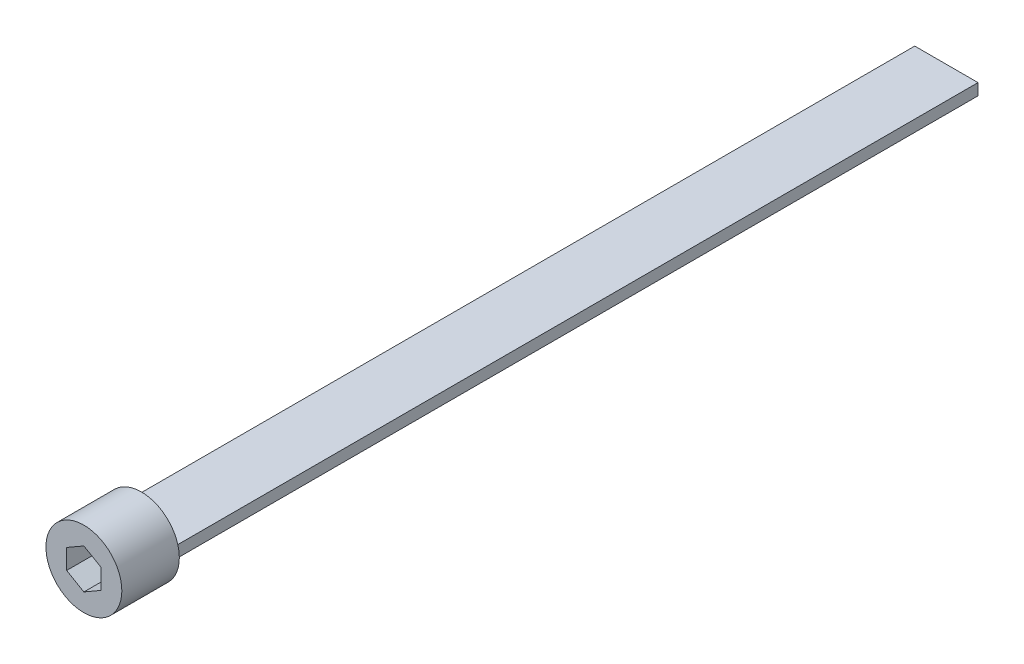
ISO-10303-21;
HEADER;
FILE_DESCRIPTION(('STEP AP214'),'2;1');
FILE_NAME('part.step','',(''),(''),'','','');
FILE_SCHEMA(('AUTOMOTIVE_DESIGN { 1 0 10303 214 1 1 1 1 }'));
ENDSEC;
DATA;
#1=APPLICATION_CONTEXT('core data for automotive mechanical design processes');
#2=APPLICATION_PROTOCOL_DEFINITION('international standard','automotive_design',2000,#1);
#3=PRODUCT_CONTEXT('',#1,'mechanical');
#4=PRODUCT('Part','Part','',(#3));
#5=PRODUCT_RELATED_PRODUCT_CATEGORY('part','',(#4));
#6=PRODUCT_DEFINITION_FORMATION('','',#4);
#7=PRODUCT_DEFINITION_CONTEXT('part definition',#1,'design');
#8=PRODUCT_DEFINITION('design','',#6,#7);
#9=PRODUCT_DEFINITION_SHAPE('','',#8);
#10=(LENGTH_UNIT() NAMED_UNIT(*) SI_UNIT(.MILLI.,.METRE.));
#11=(NAMED_UNIT(*) PLANE_ANGLE_UNIT() SI_UNIT($,.RADIAN.));
#12=(NAMED_UNIT(*) SI_UNIT($,.STERADIAN.) SOLID_ANGLE_UNIT());
#13=UNCERTAINTY_MEASURE_WITH_UNIT(LENGTH_MEASURE(1.E-05),#10,'distance_accuracy_value','');
#14=(GEOMETRIC_REPRESENTATION_CONTEXT(3) GLOBAL_UNCERTAINTY_ASSIGNED_CONTEXT((#13)) GLOBAL_UNIT_ASSIGNED_CONTEXT((#10,
#11,#12)) REPRESENTATION_CONTEXT('',''));
#15=CARTESIAN_POINT('',(0.,0.,0.));
#16=DIRECTION('',(0.,0.,1.));
#17=DIRECTION('',(1.,0.,0.));
#18=AXIS2_PLACEMENT_3D('',#15,#16,#17);
#19=CARTESIAN_POINT('',(0.,0.,0.));
#20=DIRECTION('',(0.,0.,1.));
#21=DIRECTION('',(1.,0.,0.));
#22=AXIS2_PLACEMENT_3D('',#19,#20,#21);
#23=PLANE('',#22);
#24=CARTESIAN_POINT('',(0.,0.,0.));
#25=DIRECTION('',(0.,0.,1.));
#26=DIRECTION('',(1.,0.,0.));
#27=AXIS2_PLACEMENT_3D('',#24,#25,#26);
#28=CIRCLE('',#27,6.6);
#29=CARTESIAN_POINT('',(6.6,0.,0.));
#30=VERTEX_POINT('',#29);
#31=EDGE_CURVE('E20',#30,#30,#28,.T.);
#32=ORIENTED_EDGE('',*,*,#31,.F.);
#33=EDGE_LOOP('',(#32));
#34=FACE_BOUND('',#33,.T.);
#35=DIRECTION('',(0.,-1.,0.));
#36=VECTOR('',#35,1.);
#37=CARTESIAN_POINT('',(5.5,-1.,0.));
#38=LINE('',#37,#36);
#39=CARTESIAN_POINT('',(5.5,1.,0.));
#40=VERTEX_POINT('',#39);
#41=CARTESIAN_POINT('',(5.5,-1.,0.));
#42=VERTEX_POINT('',#41);
#43=EDGE_CURVE('E31',#40,#42,#38,.T.);
#44=ORIENTED_EDGE('',*,*,#43,.F.);
#45=DIRECTION('',(1.,0.,0.));
#46=VECTOR('',#45,1.);
#47=CARTESIAN_POINT('',(-5.5,1.,0.));
#48=LINE('',#47,#46);
#49=CARTESIAN_POINT('',(-5.5,1.,0.));
#50=VERTEX_POINT('',#49);
#51=EDGE_CURVE('E35',#50,#40,#48,.T.);
#52=ORIENTED_EDGE('',*,*,#51,.F.);
#53=DIRECTION('',(0.,1.,0.));
#54=VECTOR('',#53,1.);
#55=CARTESIAN_POINT('',(-5.5,-1.,0.));
#56=LINE('',#55,#54);
#57=CARTESIAN_POINT('',(-5.5,-1.,0.));
#58=VERTEX_POINT('',#57);
#59=EDGE_CURVE('E324',#58,#50,#56,.T.);
#60=ORIENTED_EDGE('',*,*,#59,.F.);
#61=DIRECTION('',(-1.,0.,0.));
#62=VECTOR('',#61,1.);
#63=CARTESIAN_POINT('',(-5.5,-1.,0.));
#64=LINE('',#63,#62);
#65=EDGE_CURVE('E330',#42,#58,#64,.T.);
#66=ORIENTED_EDGE('',*,*,#65,.F.);
#67=EDGE_LOOP('',(#44,#52,#60,#66));
#68=FACE_BOUND('',#67,.T.);
#69=ADVANCED_FACE('F16',(#34,#68),#23,.F.);
#70=CARTESIAN_POINT('',(0.,0.,10.));
#71=DIRECTION('',(0.,0.,-1.));
#72=DIRECTION('',(-1.,0.,0.));
#73=AXIS2_PLACEMENT_3D('',#70,#71,#72);
#74=CYLINDRICAL_SURFACE('',#73,6.6);
#75=CARTESIAN_POINT('',(0.,0.,10.));
#76=DIRECTION('',(0.,0.,1.));
#77=DIRECTION('',(1.,0.,0.));
#78=AXIS2_PLACEMENT_3D('',#75,#76,#77);
#79=CIRCLE('',#78,6.6);
#80=CARTESIAN_POINT('',(6.6,0.,10.));
#81=VERTEX_POINT('',#80);
#82=EDGE_CURVE('E10',#81,#81,#79,.T.);
#83=ORIENTED_EDGE('',*,*,#82,.F.);
#84=EDGE_LOOP('',(#83));
#85=FACE_BOUND('',#84,.T.);
#86=ORIENTED_EDGE('',*,*,#31,.T.);
#87=EDGE_LOOP('',(#86));
#88=FACE_BOUND('',#87,.T.);
#89=ADVANCED_FACE('F18',(#85,#88),#74,.T.);
#90=CARTESIAN_POINT('',(0.,0.,10.));
#91=DIRECTION('',(0.,0.,1.));
#92=DIRECTION('',(1.,0.,0.));
#93=AXIS2_PLACEMENT_3D('',#90,#91,#92);
#94=PLANE('',#93);
#95=DIRECTION('',(-0.866025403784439,0.5,0.));
#96=VECTOR('',#95,1.);
#97=CARTESIAN_POINT('',(3.,1.73205080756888,10.));
#98=LINE('',#97,#96);
#99=CARTESIAN_POINT('',(3.,1.73205080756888,10.));
#100=VERTEX_POINT('',#99);
#101=CARTESIAN_POINT('',(0.,3.46410161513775,10.));
#102=VERTEX_POINT('',#101);
#103=EDGE_CURVE('E113',#100,#102,#98,.T.);
#104=ORIENTED_EDGE('',*,*,#103,.F.);
#105=DIRECTION('',(0.,1.,0.));
#106=VECTOR('',#105,1.);
#107=CARTESIAN_POINT('',(3.,-1.73205080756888,10.));
#108=LINE('',#107,#106);
#109=CARTESIAN_POINT('',(3.,-1.73205080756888,10.));
#110=VERTEX_POINT('',#109);
#111=EDGE_CURVE('E125',#110,#100,#108,.T.);
#112=ORIENTED_EDGE('',*,*,#111,.F.);
#113=DIRECTION('',(0.866025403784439,0.5,0.));
#114=VECTOR('',#113,1.);
#115=CARTESIAN_POINT('',(0.,-3.46410161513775,10.));
#116=LINE('',#115,#114);
#117=CARTESIAN_POINT('',(0.,-3.46410161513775,10.));
#118=VERTEX_POINT('',#117);
#119=EDGE_CURVE('E149',#118,#110,#116,.T.);
#120=ORIENTED_EDGE('',*,*,#119,.F.);
#121=DIRECTION('',(0.866025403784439,-0.5,0.));
#122=VECTOR('',#121,1.);
#123=CARTESIAN_POINT('',(-3.,-1.73205080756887,10.));
#124=LINE('',#123,#122);
#125=CARTESIAN_POINT('',(-3.,-1.73205080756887,10.));
#126=VERTEX_POINT('',#125);
#127=EDGE_CURVE('E146',#126,#118,#124,.T.);
#128=ORIENTED_EDGE('',*,*,#127,.F.);
#129=DIRECTION('',(0.,-1.,0.));
#130=VECTOR('',#129,1.);
#131=CARTESIAN_POINT('',(-3.,1.73205080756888,10.));
#132=LINE('',#131,#130);
#133=CARTESIAN_POINT('',(-3.,1.73205080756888,10.));
#134=VERTEX_POINT('',#133);
#135=EDGE_CURVE('E143',#134,#126,#132,.T.);
#136=ORIENTED_EDGE('',*,*,#135,.F.);
#137=DIRECTION('',(-0.866025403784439,-0.5,0.));
#138=VECTOR('',#137,1.);
#139=CARTESIAN_POINT('',(0.,3.46410161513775,10.));
#140=LINE('',#139,#138);
#141=EDGE_CURVE('E115',#102,#134,#140,.T.);
#142=ORIENTED_EDGE('',*,*,#141,.F.);
#143=EDGE_LOOP('',(#104,#112,#120,#128,#136,#142));
#144=FACE_BOUND('',#143,.T.);
#145=ORIENTED_EDGE('',*,*,#82,.T.);
#146=EDGE_LOOP('',(#145));
#147=FACE_BOUND('',#146,.T.);
#148=ADVANCED_FACE('F174',(#144,#147),#94,.T.);
#149=CARTESIAN_POINT('',(3.,1.73205080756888,3.));
#150=DIRECTION('',(0.5,0.866025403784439,0.));
#151=DIRECTION('',(-0.866025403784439,0.5,0.));
#152=AXIS2_PLACEMENT_3D('',#149,#150,#151);
#153=PLANE('',#152);
#154=ORIENTED_EDGE('',*,*,#103,.T.);
#155=DIRECTION('',(0.,0.,1.));
#156=VECTOR('',#155,1.);
#157=CARTESIAN_POINT('',(0.,3.46410161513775,3.));
#158=LINE('',#157,#156);
#159=CARTESIAN_POINT('',(0.,3.46410161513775,3.));
#160=VERTEX_POINT('',#159);
#161=EDGE_CURVE('E139',#160,#102,#158,.T.);
#162=ORIENTED_EDGE('',*,*,#161,.F.);
#163=DIRECTION('',(-0.866025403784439,0.5,0.));
#164=VECTOR('',#163,1.);
#165=CARTESIAN_POINT('',(3.,1.73205080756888,3.));
#166=LINE('',#165,#164);
#167=CARTESIAN_POINT('',(3.,1.73205080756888,3.));
#168=VERTEX_POINT('',#167);
#169=EDGE_CURVE('E121',#168,#160,#166,.T.);
#170=ORIENTED_EDGE('',*,*,#169,.F.);
#171=DIRECTION('',(0.,0.,1.));
#172=VECTOR('',#171,1.);
#173=CARTESIAN_POINT('',(3.,1.73205080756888,3.));
#174=LINE('',#173,#172);
#175=EDGE_CURVE('E154',#168,#100,#174,.T.);
#176=ORIENTED_EDGE('',*,*,#175,.T.);
#177=EDGE_LOOP('',(#154,#162,#170,#176));
#178=FACE_BOUND('',#177,.T.);
#179=ADVANCED_FACE('F186',(#178),#153,.F.);
#180=CARTESIAN_POINT('',(3.,-1.73205080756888,3.));
#181=DIRECTION('',(1.,0.,0.));
#182=DIRECTION('',(0.,1.,0.));
#183=AXIS2_PLACEMENT_3D('',#180,#181,#182);
#184=PLANE('',#183);
#185=ORIENTED_EDGE('',*,*,#111,.T.);
#186=ORIENTED_EDGE('',*,*,#175,.F.);
#187=DIRECTION('',(0.,1.,0.));
#188=VECTOR('',#187,1.);
#189=CARTESIAN_POINT('',(3.,-1.73205080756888,3.));
#190=LINE('',#189,#188);
#191=CARTESIAN_POINT('',(3.,-1.73205080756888,3.));
#192=VERTEX_POINT('',#191);
#193=EDGE_CURVE('E137',#192,#168,#190,.T.);
#194=ORIENTED_EDGE('',*,*,#193,.F.);
#195=DIRECTION('',(0.,0.,1.));
#196=VECTOR('',#195,1.);
#197=CARTESIAN_POINT('',(3.,-1.73205080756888,3.));
#198=LINE('',#197,#196);
#199=EDGE_CURVE('E156',#192,#110,#198,.T.);
#200=ORIENTED_EDGE('',*,*,#199,.T.);
#201=EDGE_LOOP('',(#185,#186,#194,#200));
#202=FACE_BOUND('',#201,.T.);
#203=ADVANCED_FACE('F188',(#202),#184,.F.);
#204=CARTESIAN_POINT('',(0.,-3.46410161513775,3.));
#205=DIRECTION('',(0.5,-0.866025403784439,0.));
#206=DIRECTION('',(0.866025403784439,0.5,0.));
#207=AXIS2_PLACEMENT_3D('',#204,#205,#206);
#208=PLANE('',#207);
#209=ORIENTED_EDGE('',*,*,#119,.T.);
#210=ORIENTED_EDGE('',*,*,#199,.F.);
#211=DIRECTION('',(0.866025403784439,0.5,0.));
#212=VECTOR('',#211,1.);
#213=CARTESIAN_POINT('',(0.,-3.46410161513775,3.));
#214=LINE('',#213,#212);
#215=CARTESIAN_POINT('',(0.,-3.46410161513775,3.));
#216=VERTEX_POINT('',#215);
#217=EDGE_CURVE('E134',#216,#192,#214,.T.);
#218=ORIENTED_EDGE('',*,*,#217,.F.);
#219=DIRECTION('',(0.,0.,1.));
#220=VECTOR('',#219,1.);
#221=CARTESIAN_POINT('',(0.,-3.46410161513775,3.));
#222=LINE('',#221,#220);
#223=EDGE_CURVE('E158',#216,#118,#222,.T.);
#224=ORIENTED_EDGE('',*,*,#223,.T.);
#225=EDGE_LOOP('',(#209,#210,#218,#224));
#226=FACE_BOUND('',#225,.T.);
#227=ADVANCED_FACE('F190',(#226),#208,.F.);
#228=CARTESIAN_POINT('',(-3.,-1.73205080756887,3.));
#229=DIRECTION('',(-0.5,-0.866025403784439,0.));
#230=DIRECTION('',(0.866025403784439,-0.5,0.));
#231=AXIS2_PLACEMENT_3D('',#228,#229,#230);
#232=PLANE('',#231);
#233=ORIENTED_EDGE('',*,*,#127,.T.);
#234=ORIENTED_EDGE('',*,*,#223,.F.);
#235=DIRECTION('',(0.866025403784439,-0.5,0.));
#236=VECTOR('',#235,1.);
#237=CARTESIAN_POINT('',(-3.,-1.73205080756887,3.));
#238=LINE('',#237,#236);
#239=CARTESIAN_POINT('',(-3.,-1.73205080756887,3.));
#240=VERTEX_POINT('',#239);
#241=EDGE_CURVE('E131',#240,#216,#238,.T.);
#242=ORIENTED_EDGE('',*,*,#241,.F.);
#243=DIRECTION('',(0.,0.,1.));
#244=VECTOR('',#243,1.);
#245=CARTESIAN_POINT('',(-3.,-1.73205080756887,3.));
#246=LINE('',#245,#244);
#247=EDGE_CURVE('E160',#240,#126,#246,.T.);
#248=ORIENTED_EDGE('',*,*,#247,.T.);
#249=EDGE_LOOP('',(#233,#234,#242,#248));
#250=FACE_BOUND('',#249,.T.);
#251=ADVANCED_FACE('F193',(#250),#232,.F.);
#252=CARTESIAN_POINT('',(-3.,1.73205080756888,3.));
#253=DIRECTION('',(-1.,0.,0.));
#254=DIRECTION('',(0.,0.,1.));
#255=AXIS2_PLACEMENT_3D('',#252,#253,#254);
#256=PLANE('',#255);
#257=ORIENTED_EDGE('',*,*,#135,.T.);
#258=ORIENTED_EDGE('',*,*,#247,.F.);
#259=DIRECTION('',(0.,-1.,0.));
#260=VECTOR('',#259,1.);
#261=CARTESIAN_POINT('',(-3.,1.73205080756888,3.));
#262=LINE('',#261,#260);
#263=CARTESIAN_POINT('',(-3.,1.73205080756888,3.));
#264=VERTEX_POINT('',#263);
#265=EDGE_CURVE('E128',#264,#240,#262,.T.);
#266=ORIENTED_EDGE('',*,*,#265,.F.);
#267=DIRECTION('',(0.,0.,1.));
#268=VECTOR('',#267,1.);
#269=CARTESIAN_POINT('',(-3.,1.73205080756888,3.));
#270=LINE('',#269,#268);
#271=EDGE_CURVE('E162',#264,#134,#270,.T.);
#272=ORIENTED_EDGE('',*,*,#271,.T.);
#273=EDGE_LOOP('',(#257,#258,#266,#272));
#274=FACE_BOUND('',#273,.T.);
#275=ADVANCED_FACE('F180',(#274),#256,.F.);
#276=CARTESIAN_POINT('',(0.,3.46410161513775,3.));
#277=DIRECTION('',(-0.5,0.866025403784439,0.));
#278=DIRECTION('',(-0.866025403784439,-0.5,0.));
#279=AXIS2_PLACEMENT_3D('',#276,#277,#278);
#280=PLANE('',#279);
#281=ORIENTED_EDGE('',*,*,#141,.T.);
#282=ORIENTED_EDGE('',*,*,#271,.F.);
#283=DIRECTION('',(-0.866025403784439,-0.5,0.));
#284=VECTOR('',#283,1.);
#285=CARTESIAN_POINT('',(0.,3.46410161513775,3.));
#286=LINE('',#285,#284);
#287=EDGE_CURVE('E124',#160,#264,#286,.T.);
#288=ORIENTED_EDGE('',*,*,#287,.F.);
#289=ORIENTED_EDGE('',*,*,#161,.T.);
#290=EDGE_LOOP('',(#281,#282,#288,#289));
#291=FACE_BOUND('',#290,.T.);
#292=ADVANCED_FACE('F168',(#291),#280,.F.);
#293=CARTESIAN_POINT('',(0.,0.,3.));
#294=DIRECTION('',(0.,0.,1.));
#295=DIRECTION('',(1.,0.,0.));
#296=AXIS2_PLACEMENT_3D('',#293,#294,#295);
#297=PLANE('',#296);
#298=ORIENTED_EDGE('',*,*,#169,.T.);
#299=ORIENTED_EDGE('',*,*,#287,.T.);
#300=ORIENTED_EDGE('',*,*,#265,.T.);
#301=ORIENTED_EDGE('',*,*,#241,.T.);
#302=ORIENTED_EDGE('',*,*,#217,.T.);
#303=ORIENTED_EDGE('',*,*,#193,.T.);
#304=EDGE_LOOP('',(#298,#299,#300,#301,#302,#303));
#305=FACE_BOUND('',#304,.T.);
#306=ADVANCED_FACE('F184',(#305),#297,.T.);
#307=CARTESIAN_POINT('',(5.5,-1.,-140.));
#308=DIRECTION('',(-1.,0.,0.));
#309=DIRECTION('',(0.,0.,1.));
#310=AXIS2_PLACEMENT_3D('',#307,#308,#309);
#311=PLANE('',#310);
#312=ORIENTED_EDGE('',*,*,#43,.T.);
#313=DIRECTION('',(0.,0.,1.));
#314=VECTOR('',#313,1.);
#315=CARTESIAN_POINT('',(5.5,-1.,-140.));
#316=LINE('',#315,#314);
#317=CARTESIAN_POINT('',(5.5,-1.,-140.));
#318=VERTEX_POINT('',#317);
#319=EDGE_CURVE('E96',#318,#42,#316,.T.);
#320=ORIENTED_EDGE('',*,*,#319,.F.);
#321=DIRECTION('',(0.,-1.,0.));
#322=VECTOR('',#321,1.);
#323=CARTESIAN_POINT('',(5.5,-1.,-140.));
#324=LINE('',#323,#322);
#325=CARTESIAN_POINT('',(5.5,1.,-140.));
#326=VERTEX_POINT('',#325);
#327=EDGE_CURVE('E102',#326,#318,#324,.T.);
#328=ORIENTED_EDGE('',*,*,#327,.F.);
#329=DIRECTION('',(0.,0.,1.));
#330=VECTOR('',#329,1.);
#331=CARTESIAN_POINT('',(5.5,1.,-140.));
#332=LINE('',#331,#330);
#333=EDGE_CURVE('E322',#326,#40,#332,.T.);
#334=ORIENTED_EDGE('',*,*,#333,.T.);
#335=EDGE_LOOP('',(#312,#320,#328,#334));
#336=FACE_BOUND('',#335,.T.);
#337=ADVANCED_FACE('F112',(#336),#311,.F.);
#338=CARTESIAN_POINT('',(-5.5,-1.,-140.));
#339=DIRECTION('',(0.,1.,0.));
#340=DIRECTION('',(-1.,0.,0.));
#341=AXIS2_PLACEMENT_3D('',#338,#339,#340);
#342=PLANE('',#341);
#343=ORIENTED_EDGE('',*,*,#65,.T.);
#344=DIRECTION('',(0.,0.,1.));
#345=VECTOR('',#344,1.);
#346=CARTESIAN_POINT('',(-5.5,-1.,-140.));
#347=LINE('',#346,#345);
#348=CARTESIAN_POINT('',(-5.5,-1.,-140.));
#349=VERTEX_POINT('',#348);
#350=EDGE_CURVE('E98',#349,#58,#347,.T.);
#351=ORIENTED_EDGE('',*,*,#350,.F.);
#352=DIRECTION('',(-1.,0.,0.));
#353=VECTOR('',#352,1.);
#354=CARTESIAN_POINT('',(-5.5,-1.,-140.));
#355=LINE('',#354,#353);
#356=EDGE_CURVE('E91',#318,#349,#355,.T.);
#357=ORIENTED_EDGE('',*,*,#356,.F.);
#358=ORIENTED_EDGE('',*,*,#319,.T.);
#359=EDGE_LOOP('',(#343,#351,#357,#358));
#360=FACE_BOUND('',#359,.T.);
#361=ADVANCED_FACE('F94',(#360),#342,.F.);
#362=CARTESIAN_POINT('',(-5.5,-1.,-140.));
#363=DIRECTION('',(1.,0.,0.));
#364=DIRECTION('',(0.,0.,-1.));
#365=AXIS2_PLACEMENT_3D('',#362,#363,#364);
#366=PLANE('',#365);
#367=ORIENTED_EDGE('',*,*,#59,.T.);
#368=DIRECTION('',(0.,0.,1.));
#369=VECTOR('',#368,1.);
#370=CARTESIAN_POINT('',(-5.5,1.,-140.));
#371=LINE('',#370,#369);
#372=CARTESIAN_POINT('',(-5.5,1.,-140.));
#373=VERTEX_POINT('',#372);
#374=EDGE_CURVE('E117',#373,#50,#371,.T.);
#375=ORIENTED_EDGE('',*,*,#374,.F.);
#376=DIRECTION('',(0.,1.,0.));
#377=VECTOR('',#376,1.);
#378=CARTESIAN_POINT('',(-5.5,-1.,-140.));
#379=LINE('',#378,#377);
#380=EDGE_CURVE('E101',#349,#373,#379,.T.);
#381=ORIENTED_EDGE('',*,*,#380,.F.);
#382=ORIENTED_EDGE('',*,*,#350,.T.);
#383=EDGE_LOOP('',(#367,#375,#381,#382));
#384=FACE_BOUND('',#383,.T.);
#385=ADVANCED_FACE('F291',(#384),#366,.F.);
#386=CARTESIAN_POINT('',(-5.5,1.,-140.));
#387=DIRECTION('',(0.,-1.,0.));
#388=DIRECTION('',(1.,0.,0.));
#389=AXIS2_PLACEMENT_3D('',#386,#387,#388);
#390=PLANE('',#389);
#391=ORIENTED_EDGE('',*,*,#51,.T.);
#392=ORIENTED_EDGE('',*,*,#333,.F.);
#393=DIRECTION('',(1.,0.,0.));
#394=VECTOR('',#393,1.);
#395=CARTESIAN_POINT('',(-5.5,1.,-140.));
#396=LINE('',#395,#394);
#397=EDGE_CURVE('E107',#373,#326,#396,.T.);
#398=ORIENTED_EDGE('',*,*,#397,.F.);
#399=ORIENTED_EDGE('',*,*,#374,.T.);
#400=EDGE_LOOP('',(#391,#392,#398,#399));
#401=FACE_BOUND('',#400,.T.);
#402=ADVANCED_FACE('F297',(#401),#390,.F.);
#403=CARTESIAN_POINT('',(0.,0.,-140.));
#404=DIRECTION('',(0.,0.,-1.));
#405=DIRECTION('',(-1.,0.,0.));
#406=AXIS2_PLACEMENT_3D('',#403,#404,#405);
#407=PLANE('',#406);
#408=ORIENTED_EDGE('',*,*,#327,.T.);
#409=ORIENTED_EDGE('',*,*,#356,.T.);
#410=ORIENTED_EDGE('',*,*,#380,.T.);
#411=ORIENTED_EDGE('',*,*,#397,.T.);
#412=EDGE_LOOP('',(#408,#409,#410,#411));
#413=FACE_BOUND('',#412,.T.);
#414=ADVANCED_FACE('F105',(#413),#407,.T.);
#415=CLOSED_SHELL('',(#69,#89,#148,#179,#203,#227,#251,#275,#292,#306,#337,#361,#385,#402,#414));
#416=MANIFOLD_SOLID_BREP('B1',#415);
#417=ADVANCED_BREP_SHAPE_REPRESENTATION('',(#18,#416),#14);
#418=SHAPE_DEFINITION_REPRESENTATION(#9,#417);
ENDSEC;
END-ISO-10303-21;
